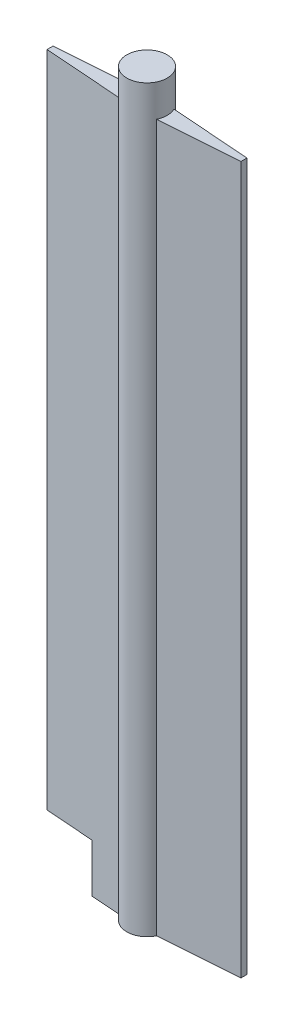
from build123d import *

# Parameters (mm, degrees)
SKETCH1_R               = 6.35
BOSS_EXTRUDE1_DEPTH     = 222.25
SKETCH2_R               = 6.35
BOSS_EXTRUDE2_DEPTH     = 10.16
CUT_EXTRUDE1_DEPTH      = 235.486163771
CUT_EXTRUDE1_DEPTH_BACK = 235.486163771
SKETCH3_W               = 15.24
SKETCH3_H               = 15.24


with BuildPart() as part:
    # Sketch1 → Boss-Extrude1 (new body)
    with BuildSketch(Plane(origin=(0, 0, 0), x_dir=(1, 0, 0), z_dir=(0, 1, 0))):
        Circle(SKETCH1_R)
        Polygon((0, 3.175), (30.48, 0.9525), (30.48, -0.9525), (0, -3.175), (-30.48, -0.9525), (-30.48, 0.9525), align=None)
    extrude(amount=BOSS_EXTRUDE1_DEPTH)

    # Sketch2 → Boss-Extrude2 (add)
    with BuildSketch(Plane(origin=(0, 222.25, 0), x_dir=(1, 0, 0), z_dir=(0, 1, 0))):
        with Locations(Location((0, 0, 0), (0, 0, 25.742011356))):
            Circle(SKETCH2_R)
    extrude(amount=BOSS_EXTRUDE2_DEPTH)

    # Sketch3 → Cut-Extrude1 (cut, two sides: drawn at the far end of the back side and taken through both)
    with BuildSketch(Plane.XY.offset(-CUT_EXTRUDE1_DEPTH_BACK)):
        with Locations((-22.86, 7.62)):
            Rectangle(SKETCH3_W, SKETCH3_H)
    extrude(amount=CUT_EXTRUDE1_DEPTH + CUT_EXTRUDE1_DEPTH_BACK, mode=Mode.SUBTRACT)


solid = part.part
